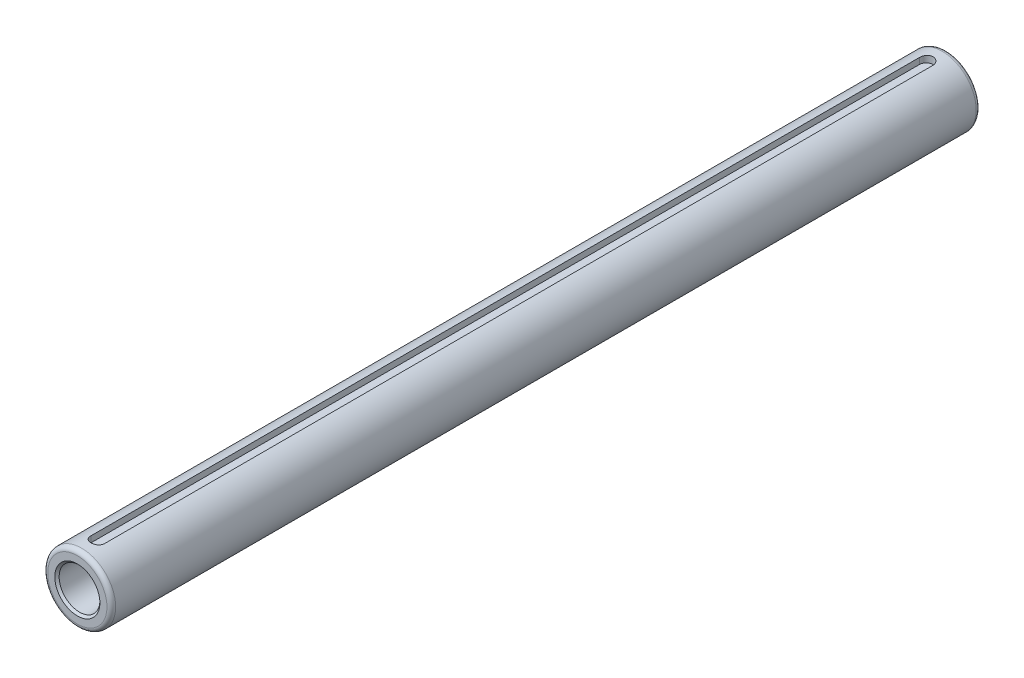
ISO-10303-21;
HEADER;
FILE_DESCRIPTION(('STEP AP214'),'2;1');
FILE_NAME('part.step','',(''),(''),'','','');
FILE_SCHEMA(('AUTOMOTIVE_DESIGN { 1 0 10303 214 1 1 1 1 }'));
ENDSEC;
DATA;
#1=APPLICATION_CONTEXT('core data for automotive mechanical design processes');
#2=APPLICATION_PROTOCOL_DEFINITION('international standard','automotive_design',2000,#1);
#3=PRODUCT_CONTEXT('',#1,'mechanical');
#4=PRODUCT('Part','Part','',(#3));
#5=PRODUCT_RELATED_PRODUCT_CATEGORY('part','',(#4));
#6=PRODUCT_DEFINITION_FORMATION('','',#4);
#7=PRODUCT_DEFINITION_CONTEXT('part definition',#1,'design');
#8=PRODUCT_DEFINITION('design','',#6,#7);
#9=PRODUCT_DEFINITION_SHAPE('','',#8);
#10=(LENGTH_UNIT() NAMED_UNIT(*) SI_UNIT(.MILLI.,.METRE.));
#11=(NAMED_UNIT(*) PLANE_ANGLE_UNIT() SI_UNIT($,.RADIAN.));
#12=(NAMED_UNIT(*) SI_UNIT($,.STERADIAN.) SOLID_ANGLE_UNIT());
#13=UNCERTAINTY_MEASURE_WITH_UNIT(LENGTH_MEASURE(1.E-05),#10,'distance_accuracy_value','');
#14=(GEOMETRIC_REPRESENTATION_CONTEXT(3) GLOBAL_UNCERTAINTY_ASSIGNED_CONTEXT((#13)) GLOBAL_UNIT_ASSIGNED_CONTEXT((#10,
#11,#12)) REPRESENTATION_CONTEXT('',''));
#15=CARTESIAN_POINT('',(0.,0.,0.));
#16=DIRECTION('',(0.,0.,1.));
#17=DIRECTION('',(1.,0.,0.));
#18=AXIS2_PLACEMENT_3D('',#15,#16,#17);
#19=CARTESIAN_POINT('',(0.,0.,203.2));
#20=DIRECTION('',(0.,0.,-1.));
#21=DIRECTION('',(-1.,0.,0.));
#22=AXIS2_PLACEMENT_3D('',#19,#20,#21);
#23=CYLINDRICAL_SURFACE('',#22,15.875);
#24=CARTESIAN_POINT('',(0.,0.,-201.168));
#25=DIRECTION('',(0.,0.,1.));
#26=DIRECTION('',(1.,0.,0.));
#27=AXIS2_PLACEMENT_3D('',#24,#25,#26);
#28=CIRCLE('',#27,15.875);
#29=CARTESIAN_POINT('',(15.875,0.,-201.168));
#30=VERTEX_POINT('',#29);
#31=EDGE_CURVE('E142',#30,#30,#28,.T.);
#32=ORIENTED_EDGE('',*,*,#31,.T.);
#33=EDGE_LOOP('',(#32));
#34=FACE_BOUND('',#33,.T.);
#35=CARTESIAN_POINT('',(0.,0.,201.168));
#36=DIRECTION('',(0.,0.,1.));
#37=DIRECTION('',(1.,0.,0.));
#38=AXIS2_PLACEMENT_3D('',#35,#36,#37);
#39=CIRCLE('',#38,15.875);
#40=CARTESIAN_POINT('',(15.875,0.,201.168));
#41=VERTEX_POINT('',#40);
#42=EDGE_CURVE('E139',#41,#41,#39,.F.);
#43=ORIENTED_EDGE('',*,*,#42,.T.);
#44=EDGE_LOOP('',(#43));
#45=FACE_BOUND('',#44,.T.);
#46=CARTESIAN_POINT('',(-3.17499999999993,15.5542598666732,193.675));
#47=CARTESIAN_POINT('',(-3.17500959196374,15.5542522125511,193.763346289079));
#48=CARTESIAN_POINT('',(-3.17131267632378,15.5550123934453,193.851687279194));
#49=CARTESIAN_POINT('',(-3.15658023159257,15.5580117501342,194.027719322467));
#50=CARTESIAN_POINT('',(-3.14554561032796,15.560250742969,194.11541045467));
#51=CARTESIAN_POINT('',(-3.11623441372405,15.5661465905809,194.289393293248));
#52=CARTESIAN_POINT('',(-3.09796887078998,15.569801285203,194.375686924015));
#53=CARTESIAN_POINT('',(-3.05435763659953,15.5784150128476,194.546374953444));
#54=CARTESIAN_POINT('',(-3.02901191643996,15.5833740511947,194.630769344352));
#55=CARTESIAN_POINT('',(-2.94260617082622,15.6000059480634,194.880236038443));
#56=CARTESIAN_POINT('',(-2.87115417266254,15.6134385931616,195.041729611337));
#57=CARTESIAN_POINT('',(-2.70272473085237,15.6434706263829,195.35037064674));
#58=CARTESIAN_POINT('',(-2.6057446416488,15.6600703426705,195.497516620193));
#59=CARTESIAN_POINT('',(-2.38754004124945,15.6948273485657,195.775443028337));
#60=CARTESIAN_POINT('',(-2.26602627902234,15.7130015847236,195.905994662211));
#61=CARTESIAN_POINT('',(-2.00282311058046,15.748712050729,196.145007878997));
#62=CARTESIAN_POINT('',(-1.86113058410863,15.7662481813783,196.253466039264));
#63=CARTESIAN_POINT('',(-1.56006830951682,15.7988892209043,196.446104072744));
#64=CARTESIAN_POINT('',(-1.40055548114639,15.8139716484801,196.530064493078));
#65=CARTESIAN_POINT('',(-1.06934377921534,15.8398132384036,196.669901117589));
#66=CARTESIAN_POINT('',(-0.89764671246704,15.8505730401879,196.725781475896));
#67=CARTESIAN_POINT('',(-0.549330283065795,15.8664375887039,196.807159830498));
#68=CARTESIAN_POINT('',(-0.372805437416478,15.8716148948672,196.833047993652));
#69=CARTESIAN_POINT('',(-0.0178431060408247,15.8759817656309,196.854924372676));
#70=CARTESIAN_POINT('',(0.160594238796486,15.8751717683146,196.850914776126));
#71=CARTESIAN_POINT('',(0.511626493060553,15.8677112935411,196.81340431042));
#72=CARTESIAN_POINT('',(0.684268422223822,15.8611441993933,196.780324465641));
#73=CARTESIAN_POINT('',(1.02149912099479,15.8430015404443,196.686280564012));
#74=CARTESIAN_POINT('',(1.18608762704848,15.8314258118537,196.625315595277));
#75=CARTESIAN_POINT('',(1.50374436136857,15.804428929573,196.476840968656));
#76=CARTESIAN_POINT('',(1.65673318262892,15.7889839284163,196.389165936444));
#77=CARTESIAN_POINT('',(1.94597794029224,15.7559518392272,196.189884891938));
#78=CARTESIAN_POINT('',(2.08223248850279,15.7383645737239,196.078276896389));
#79=CARTESIAN_POINT('',(2.33662920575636,15.7026304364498,195.832004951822));
#80=CARTESIAN_POINT('',(2.45441690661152,15.6844791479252,195.696975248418));
#81=CARTESIAN_POINT('',(2.66576460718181,15.6499466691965,195.408852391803));
#82=CARTESIAN_POINT('',(2.7593178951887,15.6335659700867,195.255754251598));
#83=CARTESIAN_POINT('',(2.91966635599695,15.6044179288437,194.935308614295));
#84=CARTESIAN_POINT('',(2.98638873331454,15.5916604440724,194.767923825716));
#85=CARTESIAN_POINT('',(3.09056753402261,15.5713481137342,194.424113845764));
#86=CARTESIAN_POINT('',(3.12806755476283,15.5637855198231,194.247702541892));
#87=CARTESIAN_POINT('',(3.15859457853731,15.5576008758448,194.004067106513));
#88=CARTESIAN_POINT('',(3.16474873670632,15.5563493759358,193.938353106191));
#89=CARTESIAN_POINT('',(3.17294629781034,15.55467956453,193.806769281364));
#90=CARTESIAN_POINT('',(3.17499658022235,15.5542598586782,193.740899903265));
#91=CARTESIAN_POINT('',(3.17500000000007,15.5542598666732,193.675));
#92=B_SPLINE_CURVE_WITH_KNOTS('',3,(#46,#47,#48,#49,#50,#51,#52,#53,#54,#55,#56,#57,#58,#59,#60,
#61,#62,#63,#64,#65,#66,#67,#68,#69,#70,#71,#72,#73,#74,#75,#76,#77,#78,#79,#80,#81,#82,#83,#84,
#85,#86,#87,#88,#89,#90,#91),.UNSPECIFIED.,.F.,.F.,(4,2,2,2,2,2,2,2,2,2,2,2,2,2,2,2,2,2,2,2,2,2,
4),(0.,0.264949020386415,0.529865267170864,0.794378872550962,1.05889355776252,1.58750877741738,
2.11617880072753,2.6514898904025,3.18688384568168,3.72693619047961,4.26690861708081,
4.79977477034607,5.33260193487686,5.85783704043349,6.38308932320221,6.91166215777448,
7.44027881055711,7.97804850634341,8.51596697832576,9.0553351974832,9.59389717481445,
9.79183489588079,9.98944052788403),.UNSPECIFIED.);
#93=CARTESIAN_POINT('',(-3.175,15.5542598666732,193.675));
#94=VERTEX_POINT('',#93);
#95=CARTESIAN_POINT('',(3.175,15.5542598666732,193.675));
#96=VERTEX_POINT('',#95);
#97=EDGE_CURVE('E60',#94,#96,#92,.T.);
#98=ORIENTED_EDGE('',*,*,#97,.F.);
#99=DIRECTION('',(0.,0.,-1.));
#100=VECTOR('',#99,1.);
#101=CARTESIAN_POINT('',(-3.175,15.5542598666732,203.2));
#102=LINE('',#101,#100);
#103=CARTESIAN_POINT('',(-3.175,15.5542598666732,-193.675));
#104=VERTEX_POINT('',#103);
#105=EDGE_CURVE('E84',#104,#94,#102,.F.);
#106=ORIENTED_EDGE('',*,*,#105,.F.);
#107=CARTESIAN_POINT('',(3.175,15.5542598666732,-193.675));
#108=CARTESIAN_POINT('',(3.17500959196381,15.5542522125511,-193.763346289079));
#109=CARTESIAN_POINT('',(3.17131267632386,15.5550123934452,-193.851687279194));
#110=CARTESIAN_POINT('',(3.15658023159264,15.5580117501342,-194.027719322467));
#111=CARTESIAN_POINT('',(3.14554561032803,15.560250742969,-194.11541045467));
#112=CARTESIAN_POINT('',(3.11623441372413,15.5661465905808,-194.289393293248));
#113=CARTESIAN_POINT('',(3.09796887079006,15.569801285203,-194.375686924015));
#114=CARTESIAN_POINT('',(3.05435763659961,15.5784150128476,-194.546374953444));
#115=CARTESIAN_POINT('',(3.02901191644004,15.5833740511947,-194.630769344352));
#116=CARTESIAN_POINT('',(2.94260617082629,15.6000059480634,-194.880236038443));
#117=CARTESIAN_POINT('',(2.87115417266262,15.6134385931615,-195.041729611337));
#118=CARTESIAN_POINT('',(2.70272473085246,15.6434706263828,-195.35037064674));
#119=CARTESIAN_POINT('',(2.60574464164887,15.6600703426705,-195.497516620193));
#120=CARTESIAN_POINT('',(2.38754004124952,15.6948273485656,-195.775443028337));
#121=CARTESIAN_POINT('',(2.26602627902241,15.7130015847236,-195.905994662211));
#122=CARTESIAN_POINT('',(2.00282311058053,15.748712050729,-196.145007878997));
#123=CARTESIAN_POINT('',(1.8611305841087,15.7662481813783,-196.253466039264));
#124=CARTESIAN_POINT('',(1.56006830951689,15.7988892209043,-196.446104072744));
#125=CARTESIAN_POINT('',(1.40055548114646,15.81397164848,-196.530064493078));
#126=CARTESIAN_POINT('',(1.06934377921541,15.8398132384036,-196.669901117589));
#127=CARTESIAN_POINT('',(0.897646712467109,15.8505730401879,-196.725781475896));
#128=CARTESIAN_POINT('',(0.549330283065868,15.8664375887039,-196.807159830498));
#129=CARTESIAN_POINT('',(0.372805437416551,15.8716148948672,-196.833047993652));
#130=CARTESIAN_POINT('',(0.0178431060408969,15.8759817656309,-196.854924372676));
#131=CARTESIAN_POINT('',(-0.160594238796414,15.8751717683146,-196.850914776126));
#132=CARTESIAN_POINT('',(-0.511626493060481,15.8677112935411,-196.81340431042));
#133=CARTESIAN_POINT('',(-0.684268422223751,15.8611441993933,-196.780324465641));
#134=CARTESIAN_POINT('',(-1.02149912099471,15.8430015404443,-196.686280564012));
#135=CARTESIAN_POINT('',(-1.18608762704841,15.8314258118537,-196.625315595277));
#136=CARTESIAN_POINT('',(-1.5037443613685,15.804428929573,-196.476840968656));
#137=CARTESIAN_POINT('',(-1.65673318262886,15.7889839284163,-196.389165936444));
#138=CARTESIAN_POINT('',(-1.94597794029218,15.7559518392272,-196.189884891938));
#139=CARTESIAN_POINT('',(-2.08223248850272,15.7383645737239,-196.078276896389));
#140=CARTESIAN_POINT('',(-2.33662920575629,15.7026304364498,-195.832004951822));
#141=CARTESIAN_POINT('',(-2.45441690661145,15.6844791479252,-195.696975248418));
#142=CARTESIAN_POINT('',(-2.66576460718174,15.6499466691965,-195.408852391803));
#143=CARTESIAN_POINT('',(-2.75931789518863,15.6335659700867,-195.255754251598));
#144=CARTESIAN_POINT('',(-2.91966635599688,15.6044179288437,-194.935308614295));
#145=CARTESIAN_POINT('',(-2.98638873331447,15.5916604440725,-194.767923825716));
#146=CARTESIAN_POINT('',(-3.09056753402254,15.5713481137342,-194.424113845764));
#147=CARTESIAN_POINT('',(-3.12806755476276,15.5637855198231,-194.247702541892));
#148=CARTESIAN_POINT('',(-3.15859457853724,15.5576008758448,-194.004067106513));
#149=CARTESIAN_POINT('',(-3.16474873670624,15.5563493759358,-193.938353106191));
#150=CARTESIAN_POINT('',(-3.17294629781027,15.55467956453,-193.806769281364));
#151=CARTESIAN_POINT('',(-3.17499658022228,15.5542598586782,-193.740899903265));
#152=CARTESIAN_POINT('',(-3.175,15.5542598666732,-193.675));
#153=B_SPLINE_CURVE_WITH_KNOTS('',3,(#107,#108,#109,#110,#111,#112,#113,#114,#115,#116,#117,
#118,#119,#120,#121,#122,#123,#124,#125,#126,#127,#128,#129,#130,#131,#132,#133,#134,#135,#136,
#137,#138,#139,#140,#141,#142,#143,#144,#145,#146,#147,#148,#149,#150,#151,#152),.UNSPECIFIED.,
.F.,.F.,(4,2,2,2,2,2,2,2,2,2,2,2,2,2,2,2,2,2,2,2,2,2,4),(0.,0.264949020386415,0.529865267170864,
0.79437887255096,1.05889355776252,1.58750877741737,2.11617880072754,2.6514898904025,
3.18688384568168,3.72693619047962,4.26690861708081,4.79977477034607,5.33260193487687,
5.85783704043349,6.38308932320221,6.91166215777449,7.44027881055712,7.97804850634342,
8.51596697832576,9.0553351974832,9.59389717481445,9.79183489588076,9.98944052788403),.UNSPECIFIED.);
#154=CARTESIAN_POINT('',(3.175,15.5542598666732,-193.675));
#155=VERTEX_POINT('',#154);
#156=EDGE_CURVE('E108',#155,#104,#153,.T.);
#157=ORIENTED_EDGE('',*,*,#156,.F.);
#158=DIRECTION('',(0.,0.,-1.));
#159=VECTOR('',#158,1.);
#160=CARTESIAN_POINT('',(3.175,15.5542598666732,203.2));
#161=LINE('',#160,#159);
#162=EDGE_CURVE('E115',#96,#155,#161,.T.);
#163=ORIENTED_EDGE('',*,*,#162,.F.);
#164=EDGE_LOOP('',(#98,#106,#157,#163));
#165=FACE_BOUND('',#164,.T.);
#166=ADVANCED_FACE('F37',(#34,#45,#165),#23,.T.);
#167=CARTESIAN_POINT('',(0.,0.,203.2));
#168=DIRECTION('',(0.,0.,1.));
#169=DIRECTION('',(1.,0.,0.));
#170=AXIS2_PLACEMENT_3D('',#167,#168,#169);
#171=PLANE('',#170);
#172=CARTESIAN_POINT('',(0.,0.,203.2));
#173=DIRECTION('',(0.,0.,1.));
#174=DIRECTION('',(1.,0.,0.));
#175=AXIS2_PLACEMENT_3D('',#172,#173,#174);
#176=CIRCLE('',#175,10.5410000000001);
#177=CARTESIAN_POINT('',(10.5410000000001,0.,203.2));
#178=VERTEX_POINT('',#177);
#179=EDGE_CURVE('E45',#178,#178,#176,.F.);
#180=ORIENTED_EDGE('',*,*,#179,.T.);
#181=EDGE_LOOP('',(#180));
#182=FACE_BOUND('',#181,.T.);
#183=CARTESIAN_POINT('',(0.,0.,203.2));
#184=DIRECTION('',(0.,0.,1.));
#185=DIRECTION('',(1.,0.,0.));
#186=AXIS2_PLACEMENT_3D('',#183,#184,#185);
#187=CIRCLE('',#186,13.843);
#188=CARTESIAN_POINT('',(13.843,0.,203.2));
#189=VERTEX_POINT('',#188);
#190=EDGE_CURVE('E148',#189,#189,#187,.T.);
#191=ORIENTED_EDGE('',*,*,#190,.T.);
#192=EDGE_LOOP('',(#191));
#193=FACE_BOUND('',#192,.T.);
#194=ADVANCED_FACE('F159',(#182,#193),#171,.T.);
#195=CARTESIAN_POINT('',(0.,0.,-203.2));
#196=DIRECTION('',(0.,0.,1.));
#197=DIRECTION('',(1.,0.,0.));
#198=AXIS2_PLACEMENT_3D('',#195,#196,#197);
#199=PLANE('',#198);
#200=CARTESIAN_POINT('',(0.,0.,-203.2));
#201=DIRECTION('',(0.,0.,1.));
#202=DIRECTION('',(1.,0.,0.));
#203=AXIS2_PLACEMENT_3D('',#200,#201,#202);
#204=CIRCLE('',#203,10.541);
#205=CARTESIAN_POINT('',(10.541,0.,-203.2));
#206=VERTEX_POINT('',#205);
#207=EDGE_CURVE('E11',#206,#206,#204,.T.);
#208=ORIENTED_EDGE('',*,*,#207,.T.);
#209=EDGE_LOOP('',(#208));
#210=FACE_BOUND('',#209,.T.);
#211=CARTESIAN_POINT('',(0.,0.,-203.2));
#212=DIRECTION('',(0.,0.,1.));
#213=DIRECTION('',(1.,0.,0.));
#214=AXIS2_PLACEMENT_3D('',#211,#212,#213);
#215=CIRCLE('',#214,13.843);
#216=CARTESIAN_POINT('',(13.843,0.,-203.2));
#217=VERTEX_POINT('',#216);
#218=EDGE_CURVE('E145',#217,#217,#215,.F.);
#219=ORIENTED_EDGE('',*,*,#218,.T.);
#220=EDGE_LOOP('',(#219));
#221=FACE_BOUND('',#220,.T.);
#222=ADVANCED_FACE('F170',(#210,#221),#199,.F.);
#223=CARTESIAN_POINT('',(0.,0.,203.2));
#224=DIRECTION('',(0.,0.,-1.));
#225=DIRECTION('',(-1.,0.,0.));
#226=AXIS2_PLACEMENT_3D('',#223,#224,#225);
#227=CYLINDRICAL_SURFACE('',#226,9.525);
#228=CARTESIAN_POINT('',(0.,0.,202.184));
#229=DIRECTION('',(0.,0.,1.));
#230=DIRECTION('',(1.,0.,0.));
#231=AXIS2_PLACEMENT_3D('',#228,#229,#230);
#232=CIRCLE('',#231,9.525);
#233=CARTESIAN_POINT('',(9.525,0.,202.184));
#234=VERTEX_POINT('',#233);
#235=EDGE_CURVE('E154',#234,#234,#232,.T.);
#236=ORIENTED_EDGE('',*,*,#235,.T.);
#237=EDGE_LOOP('',(#236));
#238=FACE_BOUND('',#237,.T.);
#239=CARTESIAN_POINT('',(0.,0.,-202.184));
#240=DIRECTION('',(0.,0.,1.));
#241=DIRECTION('',(1.,0.,0.));
#242=AXIS2_PLACEMENT_3D('',#239,#240,#241);
#243=CIRCLE('',#242,9.525);
#244=CARTESIAN_POINT('',(9.525,0.,-202.184));
#245=VERTEX_POINT('',#244);
#246=EDGE_CURVE('E151',#245,#245,#243,.F.);
#247=ORIENTED_EDGE('',*,*,#246,.T.);
#248=EDGE_LOOP('',(#247));
#249=FACE_BOUND('',#248,.T.);
#250=ADVANCED_FACE('F133',(#238,#249),#227,.F.);
#251=CARTESIAN_POINT('',(0.,25.4,193.675));
#252=DIRECTION('',(0.,-1.,0.));
#253=DIRECTION('',(0.,0.,-1.));
#254=AXIS2_PLACEMENT_3D('',#251,#252,#253);
#255=CYLINDRICAL_SURFACE('',#254,3.175);
#256=ORIENTED_EDGE('',*,*,#97,.T.);
#257=DIRECTION('',(0.,-1.,0.));
#258=VECTOR('',#257,1.);
#259=CARTESIAN_POINT('',(3.175,25.4,193.675));
#260=LINE('',#259,#258);
#261=CARTESIAN_POINT('',(3.175,12.7,193.675));
#262=VERTEX_POINT('',#261);
#263=EDGE_CURVE('E77',#96,#262,#260,.T.);
#264=ORIENTED_EDGE('',*,*,#263,.T.);
#265=CARTESIAN_POINT('',(0.,12.7,193.675));
#266=DIRECTION('',(0.,1.,0.));
#267=DIRECTION('',(0.,0.,1.));
#268=AXIS2_PLACEMENT_3D('',#265,#266,#267);
#269=CIRCLE('',#268,3.175);
#270=CARTESIAN_POINT('',(-3.175,12.7,193.675));
#271=VERTEX_POINT('',#270);
#272=EDGE_CURVE('E81',#271,#262,#269,.T.);
#273=ORIENTED_EDGE('',*,*,#272,.F.);
#274=DIRECTION('',(0.,-1.,0.));
#275=VECTOR('',#274,1.);
#276=CARTESIAN_POINT('',(-3.175,25.4,193.675));
#277=LINE('',#276,#275);
#278=EDGE_CURVE('E103',#94,#271,#277,.T.);
#279=ORIENTED_EDGE('',*,*,#278,.F.);
#280=EDGE_LOOP('',(#256,#264,#273,#279));
#281=FACE_BOUND('',#280,.T.);
#282=ADVANCED_FACE('F79',(#281),#255,.F.);
#283=CARTESIAN_POINT('',(3.175,25.4,193.675));
#284=DIRECTION('',(-1.,0.,0.));
#285=DIRECTION('',(0.,0.,1.));
#286=AXIS2_PLACEMENT_3D('',#283,#284,#285);
#287=PLANE('',#286);
#288=ORIENTED_EDGE('',*,*,#162,.T.);
#289=DIRECTION('',(0.,-1.,0.));
#290=VECTOR('',#289,1.);
#291=CARTESIAN_POINT('',(3.175,25.4,-193.675));
#292=LINE('',#291,#290);
#293=CARTESIAN_POINT('',(3.175,12.7,-193.675));
#294=VERTEX_POINT('',#293);
#295=EDGE_CURVE('E85',#155,#294,#292,.T.);
#296=ORIENTED_EDGE('',*,*,#295,.T.);
#297=DIRECTION('',(0.,0.,-1.));
#298=VECTOR('',#297,1.);
#299=CARTESIAN_POINT('',(3.175,12.7,193.675));
#300=LINE('',#299,#298);
#301=EDGE_CURVE('E88',#262,#294,#300,.T.);
#302=ORIENTED_EDGE('',*,*,#301,.F.);
#303=ORIENTED_EDGE('',*,*,#263,.F.);
#304=EDGE_LOOP('',(#288,#296,#302,#303));
#305=FACE_BOUND('',#304,.T.);
#306=ADVANCED_FACE('F89',(#305),#287,.T.);
#307=CARTESIAN_POINT('',(0.,25.4,-193.675));
#308=DIRECTION('',(0.,-1.,0.));
#309=DIRECTION('',(0.,0.,-1.));
#310=AXIS2_PLACEMENT_3D('',#307,#308,#309);
#311=CYLINDRICAL_SURFACE('',#310,3.175);
#312=ORIENTED_EDGE('',*,*,#156,.T.);
#313=DIRECTION('',(0.,-1.,0.));
#314=VECTOR('',#313,1.);
#315=CARTESIAN_POINT('',(-3.17500000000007,25.4,-193.675));
#316=LINE('',#315,#314);
#317=CARTESIAN_POINT('',(-3.17500000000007,12.7,-193.675));
#318=VERTEX_POINT('',#317);
#319=EDGE_CURVE('E52',#104,#318,#316,.T.);
#320=ORIENTED_EDGE('',*,*,#319,.T.);
#321=CARTESIAN_POINT('',(0.,12.7,-193.675));
#322=DIRECTION('',(0.,1.,0.));
#323=DIRECTION('',(0.,0.,1.));
#324=AXIS2_PLACEMENT_3D('',#321,#322,#323);
#325=CIRCLE('',#324,3.175);
#326=EDGE_CURVE('E94',#294,#318,#325,.T.);
#327=ORIENTED_EDGE('',*,*,#326,.F.);
#328=ORIENTED_EDGE('',*,*,#295,.F.);
#329=EDGE_LOOP('',(#312,#320,#327,#328));
#330=FACE_BOUND('',#329,.T.);
#331=ADVANCED_FACE('F120',(#330),#311,.F.);
#332=CARTESIAN_POINT('',(-3.175,25.4,193.675));
#333=DIRECTION('',(1.,0.,0.));
#334=DIRECTION('',(0.,0.,-1.));
#335=AXIS2_PLACEMENT_3D('',#332,#333,#334);
#336=PLANE('',#335);
#337=ORIENTED_EDGE('',*,*,#105,.T.);
#338=ORIENTED_EDGE('',*,*,#278,.T.);
#339=DIRECTION('',(0.,0.,1.));
#340=VECTOR('',#339,1.);
#341=CARTESIAN_POINT('',(-3.175,12.7,193.675));
#342=LINE('',#341,#340);
#343=EDGE_CURVE('E98',#318,#271,#342,.T.);
#344=ORIENTED_EDGE('',*,*,#343,.F.);
#345=ORIENTED_EDGE('',*,*,#319,.F.);
#346=EDGE_LOOP('',(#337,#338,#344,#345));
#347=FACE_BOUND('',#346,.T.);
#348=ADVANCED_FACE('F125',(#347),#336,.T.);
#349=CARTESIAN_POINT('',(0.,12.7,193.675));
#350=DIRECTION('',(0.,1.,0.));
#351=DIRECTION('',(0.,0.,1.));
#352=AXIS2_PLACEMENT_3D('',#349,#350,#351);
#353=PLANE('',#352);
#354=ORIENTED_EDGE('',*,*,#272,.T.);
#355=ORIENTED_EDGE('',*,*,#301,.T.);
#356=ORIENTED_EDGE('',*,*,#326,.T.);
#357=ORIENTED_EDGE('',*,*,#343,.T.);
#358=EDGE_LOOP('',(#354,#355,#356,#357));
#359=FACE_BOUND('',#358,.T.);
#360=ADVANCED_FACE('F97',(#359),#353,.T.);
#361=CARTESIAN_POINT('',(0.,0.,-201.168));
#362=DIRECTION('',(0.,0.,1.));
#363=DIRECTION('',(1.,0.,0.));
#364=AXIS2_PLACEMENT_3D('',#361,#362,#363);
#365=TOROIDAL_SURFACE('',#364,13.843,2.032);
#366=ORIENTED_EDGE('',*,*,#218,.F.);
#367=EDGE_LOOP('',(#366));
#368=FACE_BOUND('',#367,.T.);
#369=ORIENTED_EDGE('',*,*,#31,.F.);
#370=EDGE_LOOP('',(#369));
#371=FACE_BOUND('',#370,.T.);
#372=ADVANCED_FACE('F181',(#368,#371),#365,.T.);
#373=CARTESIAN_POINT('',(0.,0.,201.168));
#374=DIRECTION('',(0.,0.,1.));
#375=DIRECTION('',(1.,0.,0.));
#376=AXIS2_PLACEMENT_3D('',#373,#374,#375);
#377=TOROIDAL_SURFACE('',#376,13.843,2.032);
#378=ORIENTED_EDGE('',*,*,#42,.F.);
#379=EDGE_LOOP('',(#378));
#380=FACE_BOUND('',#379,.T.);
#381=ORIENTED_EDGE('',*,*,#190,.F.);
#382=EDGE_LOOP('',(#381));
#383=FACE_BOUND('',#382,.T.);
#384=ADVANCED_FACE('F165',(#380,#383),#377,.T.);
#385=CARTESIAN_POINT('',(0.,0.,202.184));
#386=DIRECTION('',(0.,0.,1.));
#387=DIRECTION('',(1.,0.,0.));
#388=AXIS2_PLACEMENT_3D('',#385,#386,#387);
#389=CONICAL_SURFACE('',#388,9.525,0.785398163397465);
#390=ORIENTED_EDGE('',*,*,#179,.F.);
#391=EDGE_LOOP('',(#390));
#392=FACE_BOUND('',#391,.T.);
#393=ORIENTED_EDGE('',*,*,#235,.F.);
#394=EDGE_LOOP('',(#393));
#395=FACE_BOUND('',#394,.T.);
#396=ADVANCED_FACE('F162',(#392,#395),#389,.F.);
#397=CARTESIAN_POINT('',(0.,0.,-203.2));
#398=DIRECTION('',(0.,0.,-1.));
#399=DIRECTION('',(-1.,0.,0.));
#400=AXIS2_PLACEMENT_3D('',#397,#398,#399);
#401=CONICAL_SURFACE('',#400,10.541,0.785398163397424);
#402=ORIENTED_EDGE('',*,*,#246,.F.);
#403=EDGE_LOOP('',(#402));
#404=FACE_BOUND('',#403,.T.);
#405=ORIENTED_EDGE('',*,*,#207,.F.);
#406=EDGE_LOOP('',(#405));
#407=FACE_BOUND('',#406,.T.);
#408=ADVANCED_FACE('F39',(#404,#407),#401,.F.);
#409=CLOSED_SHELL('',(#166,#194,#222,#250,#282,#306,#331,#348,#360,#372,#384,#396,#408));
#410=MANIFOLD_SOLID_BREP('B2',#409);
#411=ADVANCED_BREP_SHAPE_REPRESENTATION('',(#18,#410),#14);
#412=SHAPE_DEFINITION_REPRESENTATION(#9,#411);
ENDSEC;
END-ISO-10303-21;
